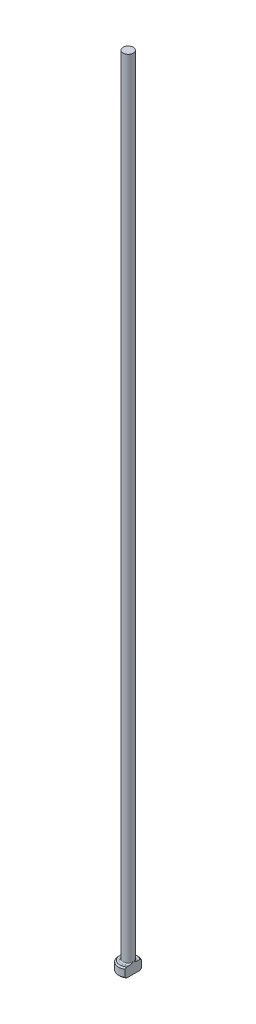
from build123d import *
from build123d.topology import SkipClean

# Parameters (mm, degrees)
CHAMFER1_SIZE = 0.2
FILLET1_R     = 0.2
KEY_DEPTH     = 126.017998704


with BuildPart() as part:
    # Sketch1 → Revolve1 (revolve)
    with BuildSketch(Plane.XY, mode=Mode.PRIVATE) as revolve1_sk:
        Polygon((0, 0), (-1.5, 0), (-1.5, 1.5), (-0.8, 1.5), (-0.8, 125), (0, 125), align=None)
    revolve(revolve1_sk.sketch.rotate(Axis((0, 259.958771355, 0), (0, -1, 0)), 270), axis=Axis((0, 259.958771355, 0), (0, -1, 0)))

    # Chamfer1
    chamfer1_edges = [part.edges().sort_by_distance(p)[0] for p in [
        (0, 1.5, -1.5),
        (0, 0, -1.5),
    ]]
    chamfer(chamfer1_edges, length=CHAMFER1_SIZE)

    # Fillet1
    fillet1_edges = [part.edges().sort_by_distance(p)[0] for p in [
        (0, 1.5, -0.8),
    ]]
    fillet(fillet1_edges, radius=FILLET1_R)

    # Sketch2 → KEY (cut, through all)
    with SkipClean():  # the faces are left unmerged after this step: merging them gives an invalid solid
        with BuildSketch(Plane(origin=(0, 0, 0), x_dir=(1, 0, 0), z_dir=(0, 1, 0))):
            with BuildLine():
                Line((0.8, 1.268857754), (0.8, -1.268857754))
                ThreePointArc((0.8, -1.268857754), (1.5, 0), (0.8, 1.268857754))
            make_face()
        extrude(amount=KEY_DEPTH, mode=Mode.SUBTRACT)


solid = part.part
